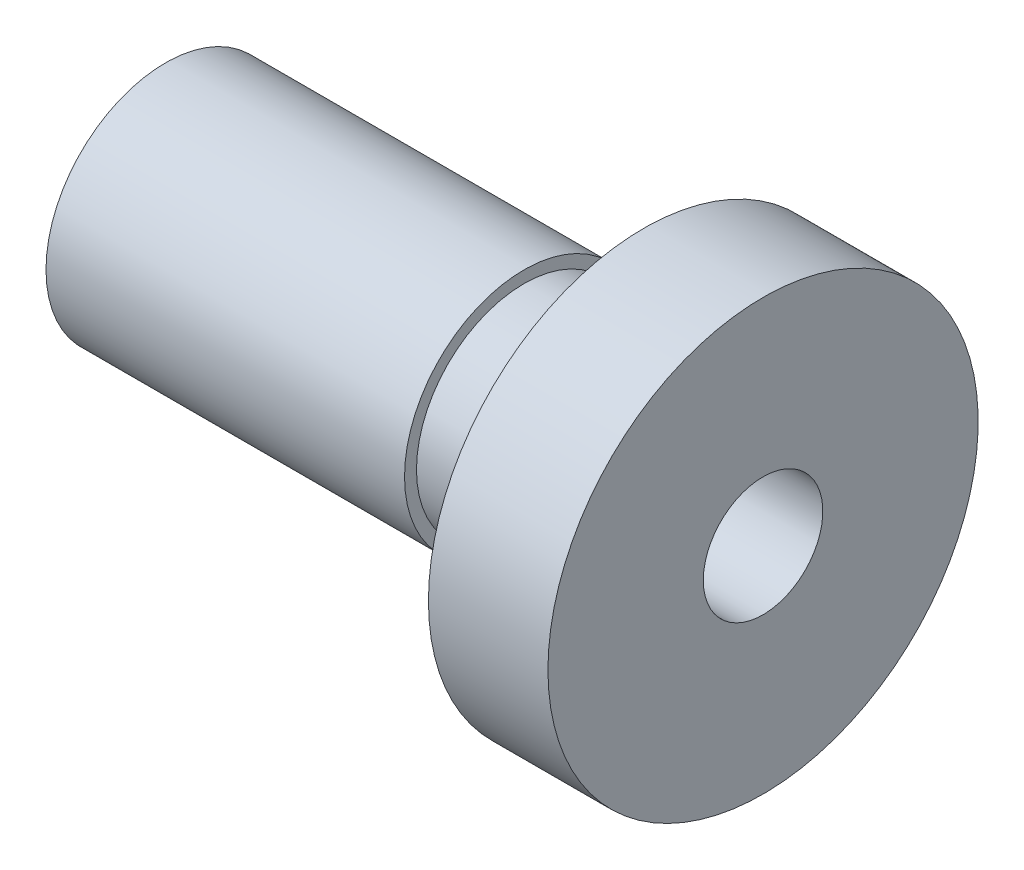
ISO-10303-21;
HEADER;
FILE_DESCRIPTION(('STEP AP214'),'2;1');
FILE_NAME('part.step','',(''),(''),'','','');
FILE_SCHEMA(('AUTOMOTIVE_DESIGN { 1 0 10303 214 1 1 1 1 }'));
ENDSEC;
DATA;
#1=APPLICATION_CONTEXT('core data for automotive mechanical design processes');
#2=APPLICATION_PROTOCOL_DEFINITION('international standard','automotive_design',2000,#1);
#3=PRODUCT_CONTEXT('',#1,'mechanical');
#4=PRODUCT('Part','Part','',(#3));
#5=PRODUCT_RELATED_PRODUCT_CATEGORY('part','',(#4));
#6=PRODUCT_DEFINITION_FORMATION('','',#4);
#7=PRODUCT_DEFINITION_CONTEXT('part definition',#1,'design');
#8=PRODUCT_DEFINITION('design','',#6,#7);
#9=PRODUCT_DEFINITION_SHAPE('','',#8);
#10=(LENGTH_UNIT() NAMED_UNIT(*) SI_UNIT(.MILLI.,.METRE.));
#11=(NAMED_UNIT(*) PLANE_ANGLE_UNIT() SI_UNIT($,.RADIAN.));
#12=(NAMED_UNIT(*) SI_UNIT($,.STERADIAN.) SOLID_ANGLE_UNIT());
#13=UNCERTAINTY_MEASURE_WITH_UNIT(LENGTH_MEASURE(1.E-05),#10,'distance_accuracy_value','');
#14=(GEOMETRIC_REPRESENTATION_CONTEXT(3) GLOBAL_UNCERTAINTY_ASSIGNED_CONTEXT((#13)) GLOBAL_UNIT_ASSIGNED_CONTEXT((#10,
#11,#12)) REPRESENTATION_CONTEXT('',''));
#15=CARTESIAN_POINT('',(0.,0.,0.));
#16=DIRECTION('',(0.,0.,1.));
#17=DIRECTION('',(1.,0.,0.));
#18=AXIS2_PLACEMENT_3D('',#15,#16,#17);
#19=CARTESIAN_POINT('',(0.,9.99999999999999,0.));
#20=DIRECTION('',(1.,0.,0.));
#21=DIRECTION('',(0.,0.,-1.));
#22=AXIS2_PLACEMENT_3D('',#19,#20,#21);
#23=PLANE('',#22);
#24=CARTESIAN_POINT('',(0.,0.,0.));
#25=DIRECTION('',(-1.,0.,0.));
#26=DIRECTION('',(0.,0.,1.));
#27=AXIS2_PLACEMENT_3D('',#24,#25,#26);
#28=CIRCLE('',#27,5.);
#29=CARTESIAN_POINT('',(0.,0.,5.));
#30=VERTEX_POINT('',#29);
#31=EDGE_CURVE('E10',#30,#30,#28,.T.);
#32=ORIENTED_EDGE('',*,*,#31,.F.);
#33=EDGE_LOOP('',(#32));
#34=FACE_BOUND('',#33,.T.);
#35=CARTESIAN_POINT('',(0.,0.,0.));
#36=DIRECTION('',(-1.,0.,0.));
#37=DIRECTION('',(0.,0.,1.));
#38=AXIS2_PLACEMENT_3D('',#35,#36,#37);
#39=CIRCLE('',#38,9.99999999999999);
#40=CARTESIAN_POINT('',(0.,0.,9.99999999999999));
#41=VERTEX_POINT('',#40);
#42=EDGE_CURVE('E52',#41,#41,#39,.T.);
#43=ORIENTED_EDGE('',*,*,#42,.T.);
#44=EDGE_LOOP('',(#43));
#45=FACE_BOUND('',#44,.T.);
#46=ADVANCED_FACE('F24',(#34,#45),#23,.F.);
#47=CARTESIAN_POINT('',(0.,0.,0.));
#48=DIRECTION('',(-1.,0.,0.));
#49=DIRECTION('',(0.,0.,1.));
#50=AXIS2_PLACEMENT_3D('',#47,#48,#49);
#51=CYLINDRICAL_SURFACE('',#50,5.);
#52=CARTESIAN_POINT('',(50.,0.,0.));
#53=DIRECTION('',(-1.,0.,0.));
#54=DIRECTION('',(0.,0.,1.));
#55=AXIS2_PLACEMENT_3D('',#52,#53,#54);
#56=CIRCLE('',#55,5.);
#57=CARTESIAN_POINT('',(50.,0.,5.));
#58=VERTEX_POINT('',#57);
#59=EDGE_CURVE('E30',#58,#58,#56,.T.);
#60=ORIENTED_EDGE('',*,*,#59,.F.);
#61=EDGE_LOOP('',(#60));
#62=FACE_BOUND('',#61,.T.);
#63=ORIENTED_EDGE('',*,*,#31,.T.);
#64=EDGE_LOOP('',(#63));
#65=FACE_BOUND('',#64,.T.);
#66=ADVANCED_FACE('F89',(#62,#65),#51,.F.);
#67=CARTESIAN_POINT('',(50.,5.,0.));
#68=DIRECTION('',(-1.,0.,0.));
#69=DIRECTION('',(0.,0.,1.));
#70=AXIS2_PLACEMENT_3D('',#67,#68,#69);
#71=PLANE('',#70);
#72=CARTESIAN_POINT('',(50.,0.,0.));
#73=DIRECTION('',(-1.,0.,0.));
#74=DIRECTION('',(0.,0.,1.));
#75=AXIS2_PLACEMENT_3D('',#72,#73,#74);
#76=CIRCLE('',#75,18.);
#77=CARTESIAN_POINT('',(50.,0.,18.));
#78=VERTEX_POINT('',#77);
#79=EDGE_CURVE('E34',#78,#78,#76,.T.);
#80=ORIENTED_EDGE('',*,*,#79,.F.);
#81=EDGE_LOOP('',(#80));
#82=FACE_BOUND('',#81,.T.);
#83=ORIENTED_EDGE('',*,*,#59,.T.);
#84=EDGE_LOOP('',(#83));
#85=FACE_BOUND('',#84,.T.);
#86=ADVANCED_FACE('F84',(#82,#85),#71,.F.);
#87=CARTESIAN_POINT('',(0.,0.,0.));
#88=DIRECTION('',(-1.,0.,0.));
#89=DIRECTION('',(0.,0.,1.));
#90=AXIS2_PLACEMENT_3D('',#87,#88,#89);
#91=CYLINDRICAL_SURFACE('',#90,18.);
#92=CARTESIAN_POINT('',(40.,0.,0.));
#93=DIRECTION('',(-1.,0.,0.));
#94=DIRECTION('',(0.,0.,1.));
#95=AXIS2_PLACEMENT_3D('',#92,#93,#94);
#96=CIRCLE('',#95,18.);
#97=CARTESIAN_POINT('',(40.,0.,18.));
#98=VERTEX_POINT('',#97);
#99=EDGE_CURVE('E38',#98,#98,#96,.T.);
#100=ORIENTED_EDGE('',*,*,#99,.F.);
#101=EDGE_LOOP('',(#100));
#102=FACE_BOUND('',#101,.T.);
#103=ORIENTED_EDGE('',*,*,#79,.T.);
#104=EDGE_LOOP('',(#103));
#105=FACE_BOUND('',#104,.T.);
#106=ADVANCED_FACE('F78',(#102,#105),#91,.T.);
#107=CARTESIAN_POINT('',(40.,18.,0.));
#108=DIRECTION('',(1.,0.,0.));
#109=DIRECTION('',(0.,0.,-1.));
#110=AXIS2_PLACEMENT_3D('',#107,#108,#109);
#111=PLANE('',#110);
#112=CARTESIAN_POINT('',(40.,0.,0.));
#113=DIRECTION('',(-1.,0.,0.));
#114=DIRECTION('',(0.,0.,1.));
#115=AXIS2_PLACEMENT_3D('',#112,#113,#114);
#116=CIRCLE('',#115,9.);
#117=CARTESIAN_POINT('',(40.,0.,9.));
#118=VERTEX_POINT('',#117);
#119=EDGE_CURVE('E43',#118,#118,#116,.T.);
#120=ORIENTED_EDGE('',*,*,#119,.F.);
#121=EDGE_LOOP('',(#120));
#122=FACE_BOUND('',#121,.T.);
#123=ORIENTED_EDGE('',*,*,#99,.T.);
#124=EDGE_LOOP('',(#123));
#125=FACE_BOUND('',#124,.T.);
#126=ADVANCED_FACE('F72',(#122,#125),#111,.F.);
#127=CARTESIAN_POINT('',(0.,0.,0.));
#128=DIRECTION('',(-1.,0.,0.));
#129=DIRECTION('',(0.,0.,1.));
#130=AXIS2_PLACEMENT_3D('',#127,#128,#129);
#131=CYLINDRICAL_SURFACE('',#130,9.);
#132=CARTESIAN_POINT('',(30.,0.,0.));
#133=DIRECTION('',(-1.,0.,0.));
#134=DIRECTION('',(0.,0.,1.));
#135=AXIS2_PLACEMENT_3D('',#132,#133,#134);
#136=CIRCLE('',#135,9.);
#137=CARTESIAN_POINT('',(30.,0.,9.));
#138=VERTEX_POINT('',#137);
#139=EDGE_CURVE('E46',#138,#138,#136,.T.);
#140=ORIENTED_EDGE('',*,*,#139,.F.);
#141=EDGE_LOOP('',(#140));
#142=FACE_BOUND('',#141,.T.);
#143=ORIENTED_EDGE('',*,*,#119,.T.);
#144=EDGE_LOOP('',(#143));
#145=FACE_BOUND('',#144,.T.);
#146=ADVANCED_FACE('F66',(#142,#145),#131,.T.);
#147=CARTESIAN_POINT('',(30.,9.,0.));
#148=DIRECTION('',(-1.,0.,0.));
#149=DIRECTION('',(0.,0.,1.));
#150=AXIS2_PLACEMENT_3D('',#147,#148,#149);
#151=PLANE('',#150);
#152=CARTESIAN_POINT('',(30.,0.,0.));
#153=DIRECTION('',(-1.,0.,0.));
#154=DIRECTION('',(0.,0.,1.));
#155=AXIS2_PLACEMENT_3D('',#152,#153,#154);
#156=CIRCLE('',#155,10.);
#157=CARTESIAN_POINT('',(30.,0.,10.));
#158=VERTEX_POINT('',#157);
#159=EDGE_CURVE('E49',#158,#158,#156,.T.);
#160=ORIENTED_EDGE('',*,*,#159,.F.);
#161=EDGE_LOOP('',(#160));
#162=FACE_BOUND('',#161,.T.);
#163=ORIENTED_EDGE('',*,*,#139,.T.);
#164=EDGE_LOOP('',(#163));
#165=FACE_BOUND('',#164,.T.);
#166=ADVANCED_FACE('F60',(#162,#165),#151,.F.);
#167=CARTESIAN_POINT('',(0.,0.,0.));
#168=DIRECTION('',(-1.,0.,0.));
#169=DIRECTION('',(0.,0.,1.));
#170=AXIS2_PLACEMENT_3D('',#167,#168,#169);
#171=CYLINDRICAL_SURFACE('',#170,10.);
#172=ORIENTED_EDGE('',*,*,#42,.F.);
#173=EDGE_LOOP('',(#172));
#174=FACE_BOUND('',#173,.T.);
#175=ORIENTED_EDGE('',*,*,#159,.T.);
#176=EDGE_LOOP('',(#175));
#177=FACE_BOUND('',#176,.T.);
#178=ADVANCED_FACE('F57',(#174,#177),#171,.T.);
#179=CLOSED_SHELL('',(#46,#66,#86,#106,#126,#146,#166,#178));
#180=MANIFOLD_SOLID_BREP('B2',#179);
#181=ADVANCED_BREP_SHAPE_REPRESENTATION('',(#18,#180),#14);
#182=SHAPE_DEFINITION_REPRESENTATION(#9,#181);
ENDSEC;
END-ISO-10303-21;
